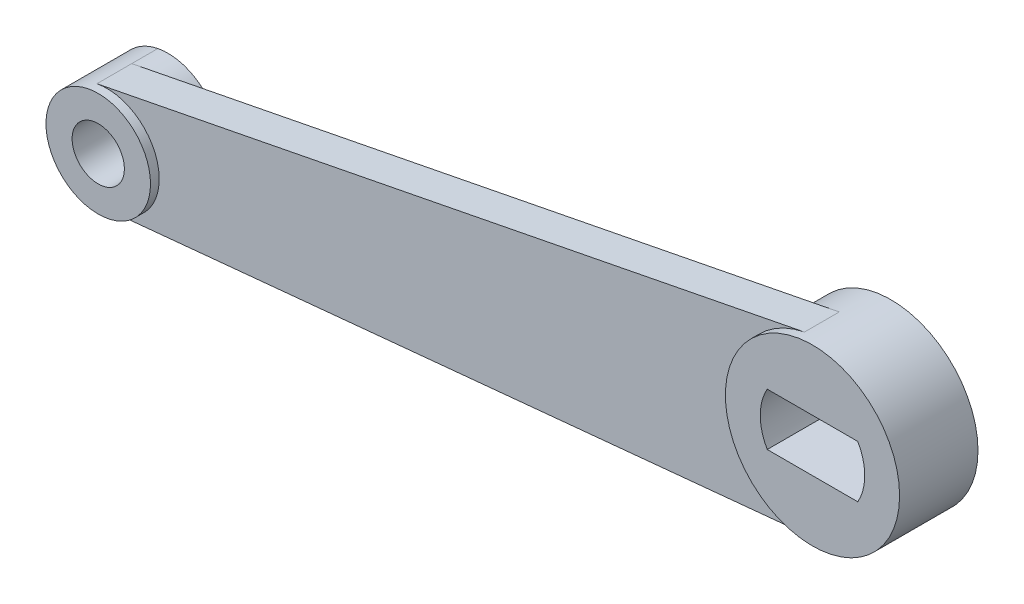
from build123d import *
from build123d.topology import SkipClean

# Parameters (mm, degrees)
EXTRUSION1_DEPTH        = 2
EXTRUSION2_DEPTH        = 2.5
EXTRUSION2_DEPTH_BACK   = 2
ESQUISSE2_R             = 5
EXTRUSION3_DEPTH        = 2.5
EXTRUSION3_DEPTH_BACK   = 1.5
ESQUISSE3_R             = 3
NERVURE1_REACH          = 47.089
ESQUISSE6_R             = 1.5
ENL_V_MAT_EXTRU_1_DEPTH = 46.135906


with BuildPart() as part:
    # Esquisse1 → Extrusion1 (new body)
    with BuildSketch(Plane.XY):
        with BuildLine():
            Line((-0.961941, 4.906595), (-41.577164, -3.056043))
            ThreePointArc((-41.577164, -3.056043), (-43.968383, -6.434398), (-40.709382, -8.98589))
            Line((-40.709382, -8.98589), (0.484363, -4.976484))
            ThreePointArc((0.484363, -4.976484), (4.947305, 0.723996), (-0.961941, 4.906595))
        make_face()
    extrude(amount=EXTRUSION1_DEPTH)

    # Esquisse2 → Extrusion2 (add, two sides: drawn at the far end of the back side and taken through both)
    with BuildSketch(Plane.XY.offset(-EXTRUSION2_DEPTH_BACK)):
        Circle(ESQUISSE2_R)
    extrude(amount=EXTRUSION2_DEPTH + EXTRUSION2_DEPTH_BACK)

    # Esquisse3 → Extrusion3 (add, two sides: drawn at the far end of the back side and taken through both)
    with SkipClean():  # the faces are left unmerged after this step: merging them gives an invalid solid
        with BuildSketch(Plane.XY.offset(-EXTRUSION3_DEPTH_BACK)):
            with Locations((-41, -6)):
                Circle(ESQUISSE3_R)
        extrude(amount=EXTRUSION3_DEPTH + EXTRUSION3_DEPTH_BACK)

    # Esquisse4 walls → Nervure1 (add, up to next)
    with BuildSketch(Plane(origin=(0, 0, -1.5), x_dir=(-1, 0, 0), z_dir=(0, 0, -1)), mode=Mode.PRIVATE) as nervure1_sk1:
        Polygon((86.711674, -11.931525), (-45.494475, 7.415716), (-45.711674, 5.931525), (86.494475, -13.415716), align=None)
    nervure1_tool1 = extrude(nervure1_sk1.sketch, amount=-NERVURE1_REACH, mode=Mode.PRIVATE) - part.part
    add(nervure1_tool1.solids().sort_by_distance((-20.5, -3, -1.5))[0])

    # Esquisse6 → Enl_v. mat.-Extru.1 (cut, through all)
    with BuildSketch(Plane.XY.offset(2.5)):
        with Locations((-41, -6)):
            Circle(ESQUISSE6_R)
        with BuildLine():
            Line((-2.598076, 1.5), (2.598076, 1.5))
            ThreePointArc((2.598076, 1.5), (3, 0), (2.598076, -1.5))
            Line((2.598076, -1.5), (-2.598076, -1.5))
            ThreePointArc((-2.598076, -1.5), (-3, 0), (-2.598076, 1.5))
        make_face()
    extrude(amount=-ENL_V_MAT_EXTRU_1_DEPTH, mode=Mode.SUBTRACT)


solid = part.part
